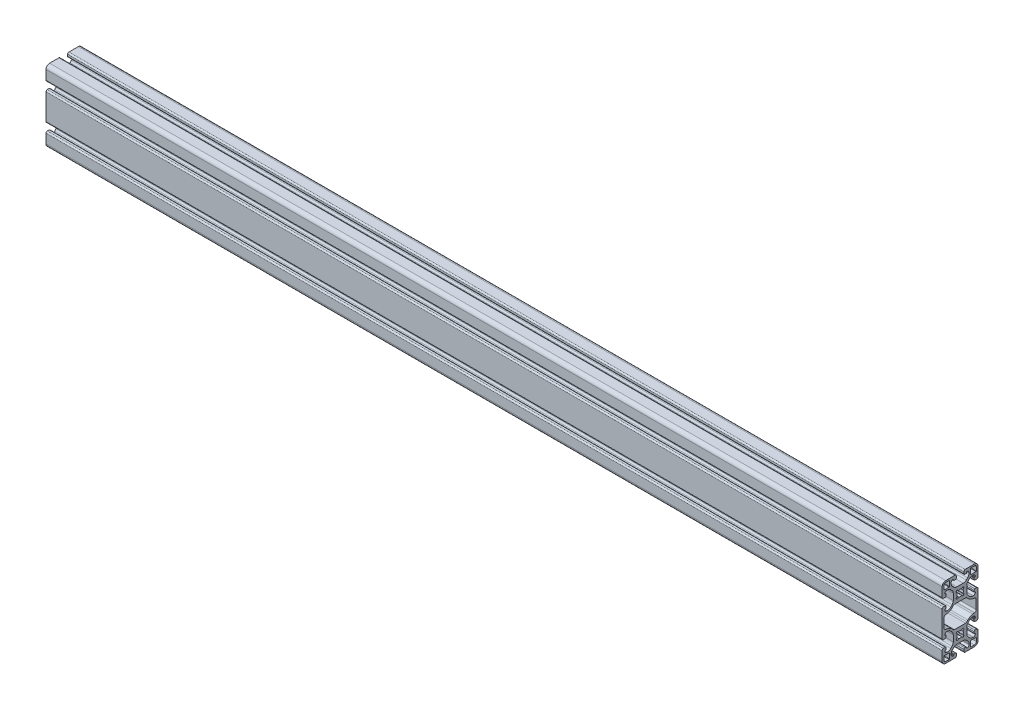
from build123d import *

# Parameters (mm, degrees)
F_40_SARJA_1_0070_40X80_1_DEPTH = 1000


with BuildPart() as part:
    # Model6 → 40-sarja 1.0070 40X80_1 (new body)
    with BuildSketch(Plane(origin=(0, 0, 0), x_dir=(0, -1, 0), z_dir=(1, 0, 0))):
        with BuildLine():
            Line((-13.35, 15.5), (-14.85, 15.5))
            ThreePointArc((-14.85, 15.5), (-15.557106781, 15.792893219), (-15.85, 16.5))
            Line((-15.85, 16.5), (-15.85, 18.5))
            ThreePointArc((-15.85, 18.5), (-15.410660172, 19.560660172), (-14.35, 20))
            Line((-14.35, 20), (14.35, 20))
            ThreePointArc((14.35, 20), (15.410660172, 19.560660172), (15.85, 18.5))
            Line((15.85, 18.5), (15.85, 16.5))
            ThreePointArc((15.85, 16.5), (15.557106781, 15.792893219), (14.85, 15.5))
            Line((14.85, 15.5), (13.35, 15.5))
            ThreePointArc((13.35, 15.5), (12.996446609, 15.646446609), (12.85, 16))
            Line((12.85, 16), (12.85, 16.5))
            ThreePointArc((12.85, 16.5), (12.703553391, 16.853553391), (12.35, 17))
            Line((12.35, 17), (12.15, 17))
            ThreePointArc((12.15, 17), (10.62972042, 16.37027958), (10, 14.85))
            Line((10, 14.85), (10, 14.056360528))
            ThreePointArc((10, 14.056360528), (10.423530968, 12.016585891), (11.624104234, 10.314034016))
            Line((11.624104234, 10.314034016), (13.084905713, 8.947996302))
            ThreePointArc((13.084905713, 8.947996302), (14.664246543, 7.949192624), (16.5, 7.6))
            Line((16.5, 7.6), (23.5, 7.6))
            ThreePointArc((23.5, 7.6), (25.335753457, 7.949192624), (26.915094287, 8.947996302))
            Line((26.915094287, 8.947996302), (28.375895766, 10.314034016))
            ThreePointArc((28.375895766, 10.314034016), (29.576469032, 12.016585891), (30, 14.056360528))
            Line((30, 14.056360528), (30, 14.85))
            ThreePointArc((30, 14.85), (29.37027958, 16.37027958), (27.85, 17))
            Line((27.85, 17), (27.65, 17))
            ThreePointArc((27.65, 17), (27.296446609, 16.853553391), (27.15, 16.5))
            Line((27.15, 16.5), (27.15, 16))
            ThreePointArc((27.15, 16), (27.003553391, 15.646446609), (26.65, 15.5))
            Line((26.65, 15.5), (25.15, 15.5))
            ThreePointArc((25.15, 15.5), (24.442893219, 15.792893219), (24.15, 16.5))
            Line((24.15, 16.5), (24.15, 18.5))
            ThreePointArc((24.15, 18.5), (24.589339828, 19.560660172), (25.65, 20))
            Line((25.65, 20), (36, 20))
            ThreePointArc((36, 20), (38.828427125, 18.828427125), (40, 16))
            Line((40, 16), (40, 5.65))
            ThreePointArc((40, 5.65), (39.560660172, 4.589339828), (38.5, 4.15))
            Line((38.5, 4.15), (36.5, 4.15))
            ThreePointArc((36.5, 4.15), (35.792893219, 4.442893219), (35.5, 5.15))
            Line((35.5, 5.15), (35.5, 6.65))
            ThreePointArc((35.5, 6.65), (35.646446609, 7.003553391), (36, 7.15))
            Line((36, 7.15), (36.5, 7.15))
            ThreePointArc((36.5, 7.15), (36.853553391, 7.296446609), (37, 7.65))
            Line((37, 7.65), (37, 7.85))
            ThreePointArc((37, 7.85), (36.37027958, 9.37027958), (34.85, 10))
            Line((34.85, 10), (34.203267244, 10))
            ThreePointArc((34.203267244, 10), (32.163150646, 9.576049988), (30.460844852, 8.374399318))
            Line((30.460844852, 8.374399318), (29.095763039, 6.912704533))
            ThreePointArc((29.095763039, 6.912704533), (28.098592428, 5.334232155), (27.75, 3.5))
            Line((27.75, 3.5), (27.75, -3.5))
            ThreePointArc((27.75, -3.5), (28.098592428, -5.334232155), (29.095763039, -6.912704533))
            Line((29.095763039, -6.912704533), (30.460844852, -8.374399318))
            ThreePointArc((30.460844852, -8.374399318), (32.163150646, -9.576049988), (34.203267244, -10))
            Line((34.203267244, -10), (34.85, -10))
            ThreePointArc((34.85, -10), (36.37027958, -9.37027958), (37, -7.85))
            Line((37, -7.85), (37, -7.65))
            ThreePointArc((37, -7.65), (36.853553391, -7.296446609), (36.5, -7.15))
            Line((36.5, -7.15), (36, -7.15))
            ThreePointArc((36, -7.15), (35.646446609, -7.003553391), (35.5, -6.65))
            Line((35.5, -6.65), (35.5, -5.15))
            ThreePointArc((35.5, -5.15), (35.792893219, -4.442893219), (36.5, -4.15))
            Line((36.5, -4.15), (38.5, -4.15))
            ThreePointArc((38.5, -4.15), (39.560660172, -4.589339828), (40, -5.65))
            Line((40, -5.65), (40, -16))
            ThreePointArc((40, -16), (38.828427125, -18.828427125), (36, -20))
            Line((36, -20), (25.65, -20))
            ThreePointArc((25.65, -20), (24.589339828, -19.560660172), (24.15, -18.5))
            Line((24.15, -18.5), (24.15, -16.5))
            ThreePointArc((24.15, -16.5), (24.442893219, -15.792893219), (25.15, -15.5))
            Line((25.15, -15.5), (26.65, -15.5))
            ThreePointArc((26.65, -15.5), (27.003553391, -15.646446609), (27.15, -16))
            Line((27.15, -16), (27.15, -16.5))
            ThreePointArc((27.15, -16.5), (27.296446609, -16.853553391), (27.65, -17))
            Line((27.65, -17), (27.85, -17))
            ThreePointArc((27.85, -17), (29.37027958, -16.37027958), (30, -14.85))
            Line((30, -14.85), (30, -14.056360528))
            ThreePointArc((30, -14.056360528), (29.576469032, -12.016585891), (28.375895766, -10.314034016))
            Line((28.375895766, -10.314034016), (26.915094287, -8.947996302))
            ThreePointArc((26.915094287, -8.947996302), (25.335753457, -7.949192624), (23.5, -7.6))
            Line((23.5, -7.6), (16.5, -7.6))
            ThreePointArc((16.5, -7.6), (14.664246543, -7.949192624), (13.084905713, -8.947996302))
            Line((13.084905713, -8.947996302), (11.624104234, -10.314034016))
            ThreePointArc((11.624104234, -10.314034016), (10.423530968, -12.016585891), (10, -14.056360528))
            Line((10, -14.056360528), (10, -14.85))
            ThreePointArc((10, -14.85), (10.62972042, -16.37027958), (12.15, -17))
            Line((12.15, -17), (12.35, -17))
            ThreePointArc((12.35, -17), (12.703553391, -16.853553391), (12.85, -16.5))
            Line((12.85, -16.5), (12.85, -16))
            ThreePointArc((12.85, -16), (12.996446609, -15.646446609), (13.35, -15.5))
            Line((13.35, -15.5), (14.85, -15.5))
            ThreePointArc((14.85, -15.5), (15.557106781, -15.792893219), (15.85, -16.5))
            Line((15.85, -16.5), (15.85, -18.5))
            ThreePointArc((15.85, -18.5), (15.410660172, -19.560660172), (14.35, -20))
            Line((14.35, -20), (-14.35, -20))
            ThreePointArc((-14.35, -20), (-15.410660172, -19.560660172), (-15.85, -18.5))
            Line((-15.85, -18.5), (-15.85, -16.5))
            ThreePointArc((-15.85, -16.5), (-15.557106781, -15.792893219), (-14.85, -15.5))
            Line((-14.85, -15.5), (-13.35, -15.5))
            ThreePointArc((-13.35, -15.5), (-12.996446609, -15.646446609), (-12.85, -16))
            Line((-12.85, -16), (-12.85, -16.5))
            ThreePointArc((-12.85, -16.5), (-12.703553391, -16.853553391), (-12.35, -17))
            Line((-12.35, -17), (-12.15, -17))
            ThreePointArc((-12.15, -17), (-10.62972042, -16.37027958), (-10, -14.85))
            Line((-10, -14.85), (-10, -14.056360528))
            ThreePointArc((-10, -14.056360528), (-10.423530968, -12.016585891), (-11.624104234, -10.314034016))
            Line((-11.624104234, -10.314034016), (-13.084905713, -8.947996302))
            ThreePointArc((-13.084905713, -8.947996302), (-14.664246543, -7.949192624), (-16.5, -7.6))
            Line((-16.5, -7.6), (-23.5, -7.6))
            ThreePointArc((-23.5, -7.6), (-25.335753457, -7.949192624), (-26.915094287, -8.947996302))
            Line((-26.915094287, -8.947996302), (-28.375895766, -10.314034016))
            ThreePointArc((-28.375895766, -10.314034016), (-29.576469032, -12.016585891), (-30, -14.056360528))
            Line((-30, -14.056360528), (-30, -14.85))
            ThreePointArc((-30, -14.85), (-29.37027958, -16.37027958), (-27.85, -17))
            Line((-27.85, -17), (-27.65, -17))
            ThreePointArc((-27.65, -17), (-27.296446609, -16.853553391), (-27.15, -16.5))
            Line((-27.15, -16.5), (-27.15, -16))
            ThreePointArc((-27.15, -16), (-27.003553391, -15.646446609), (-26.65, -15.5))
            Line((-26.65, -15.5), (-25.15, -15.5))
            ThreePointArc((-25.15, -15.5), (-24.442893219, -15.792893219), (-24.15, -16.5))
            Line((-24.15, -16.5), (-24.15, -18.5))
            ThreePointArc((-24.15, -18.5), (-24.589339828, -19.560660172), (-25.65, -20))
            Line((-25.65, -20), (-36, -20))
            ThreePointArc((-36, -20), (-38.828427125, -18.828427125), (-40, -16))
            Line((-40, -16), (-40, -5.65))
            ThreePointArc((-40, -5.65), (-39.560660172, -4.589339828), (-38.5, -4.15))
            Line((-38.5, -4.15), (-36.5, -4.15))
            ThreePointArc((-36.5, -4.15), (-35.792893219, -4.442893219), (-35.5, -5.15))
            Line((-35.5, -5.15), (-35.5, -6.65))
            ThreePointArc((-35.5, -6.65), (-35.646446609, -7.003553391), (-36, -7.15))
            Line((-36, -7.15), (-36.5, -7.15))
            ThreePointArc((-36.5, -7.15), (-36.853553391, -7.296446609), (-37, -7.65))
            Line((-37, -7.65), (-37, -7.85))
            ThreePointArc((-37, -7.85), (-36.37027958, -9.37027958), (-34.85, -10))
            Line((-34.85, -10), (-34.203267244, -10))
            ThreePointArc((-34.203267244, -10), (-32.163150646, -9.576049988), (-30.460844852, -8.374399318))
            Line((-30.460844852, -8.374399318), (-29.095763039, -6.912704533))
            ThreePointArc((-29.095763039, -6.912704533), (-28.098592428, -5.334232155), (-27.75, -3.5))
            Line((-27.75, -3.5), (-27.75, 3.5))
            ThreePointArc((-27.75, 3.5), (-28.098592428, 5.334232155), (-29.095763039, 6.912704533))
            Line((-29.095763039, 6.912704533), (-30.460844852, 8.374399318))
            ThreePointArc((-30.460844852, 8.374399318), (-32.163150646, 9.576049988), (-34.203267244, 10))
            Line((-34.203267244, 10), (-34.85, 10))
            ThreePointArc((-34.85, 10), (-36.37027958, 9.37027958), (-37, 7.85))
            Line((-37, 7.85), (-37, 7.65))
            ThreePointArc((-37, 7.65), (-36.853553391, 7.296446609), (-36.5, 7.15))
            Line((-36.5, 7.15), (-36, 7.15))
            ThreePointArc((-36, 7.15), (-35.646446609, 7.003553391), (-35.5, 6.65))
            Line((-35.5, 6.65), (-35.5, 5.15))
            ThreePointArc((-35.5, 5.15), (-35.792893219, 4.442893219), (-36.5, 4.15))
            Line((-36.5, 4.15), (-38.5, 4.15))
            ThreePointArc((-38.5, 4.15), (-39.560660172, 4.589339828), (-40, 5.65))
            Line((-40, 5.65), (-40, 16))
            ThreePointArc((-40, 16), (-38.828427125, 18.828427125), (-36, 20))
            Line((-36, 20), (-25.65, 20))
            ThreePointArc((-25.65, 20), (-24.589339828, 19.560660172), (-24.15, 18.5))
            Line((-24.15, 18.5), (-24.15, 16.5))
            ThreePointArc((-24.15, 16.5), (-24.442893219, 15.792893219), (-25.15, 15.5))
            Line((-25.15, 15.5), (-26.65, 15.5))
            ThreePointArc((-26.65, 15.5), (-27.003553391, 15.646446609), (-27.15, 16))
            Line((-27.15, 16), (-27.15, 16.5))
            ThreePointArc((-27.15, 16.5), (-27.296446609, 16.853553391), (-27.65, 17))
            Line((-27.65, 17), (-27.85, 17))
            ThreePointArc((-27.85, 17), (-29.37027958, 16.37027958), (-30, 14.85))
            Line((-30, 14.85), (-30, 14.056360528))
            ThreePointArc((-30, 14.056360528), (-29.576469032, 12.016585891), (-28.375895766, 10.314034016))
            Line((-28.375895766, 10.314034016), (-26.915094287, 8.947996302))
            ThreePointArc((-26.915094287, 8.947996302), (-25.335753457, 7.949192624), (-23.5, 7.6))
            Line((-23.5, 7.6), (-16.5, 7.6))
            ThreePointArc((-16.5, 7.6), (-14.664246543, 7.949192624), (-13.084905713, 8.947996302))
            Line((-13.084905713, 8.947996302), (-11.624104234, 10.314034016))
            ThreePointArc((-11.624104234, 10.314034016), (-10.423530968, 12.016585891), (-10, 14.056360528))
            Line((-10, 14.056360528), (-10, 14.85))
            ThreePointArc((-10, 14.85), (-10.62972042, 16.37027958), (-12.15, 17))
            Line((-12.15, 17), (-12.35, 17))
            ThreePointArc((-12.35, 17), (-12.703553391, 16.853553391), (-12.85, 16.5))
            Line((-12.85, 16.5), (-12.85, 16))
            ThreePointArc((-12.85, 16), (-12.996446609, 15.646446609), (-13.35, 15.5))
        make_face()
        with BuildLine():
            Line((-31.8, 17.7), (-31.8, 12.3))
            ThreePointArc((-31.8, 12.3), (-31.946446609, 11.946446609), (-32.3, 11.8))
            Line((-32.3, 11.8), (-37.7, 11.8))
            ThreePointArc((-37.7, 11.8), (-38.053553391, 11.946446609), (-38.2, 12.3))
            Line((-38.2, 12.3), (-38.2, 16))
            ThreePointArc((-38.2, 16), (-37.555634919, 17.555634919), (-36, 18.2))
            Line((-36, 18.2), (-32.3, 18.2))
            ThreePointArc((-32.3, 18.2), (-31.946446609, 18.053553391), (-31.8, 17.7))
        make_face(mode=Mode.SUBTRACT)
        with BuildLine():
            Line((-37.7, -11.8), (-32.3, -11.8))
            ThreePointArc((-32.3, -11.8), (-31.946446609, -11.946446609), (-31.8, -12.3))
            Line((-31.8, -12.3), (-31.8, -17.7))
            ThreePointArc((-31.8, -17.7), (-31.946446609, -18.053553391), (-32.3, -18.2))
            Line((-32.3, -18.2), (-36, -18.2))
            ThreePointArc((-36, -18.2), (-37.555634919, -17.555634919), (-38.2, -16))
            Line((-38.2, -16), (-38.2, -12.3))
            ThreePointArc((-38.2, -12.3), (-38.053553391, -11.946446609), (-37.7, -11.8))
        make_face(mode=Mode.SUBTRACT)
        with BuildLine():
            Line((37.7, 11.8), (32.3, 11.8))
            ThreePointArc((32.3, 11.8), (31.946446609, 11.946446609), (31.8, 12.3))
            Line((31.8, 12.3), (31.8, 17.7))
            ThreePointArc((31.8, 17.7), (31.946446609, 18.053553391), (32.3, 18.2))
            Line((32.3, 18.2), (36, 18.2))
            ThreePointArc((36, 18.2), (37.555634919, 17.555634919), (38.2, 16))
            Line((38.2, 16), (38.2, 12.3))
            ThreePointArc((38.2, 12.3), (38.053553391, 11.946446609), (37.7, 11.8))
        make_face(mode=Mode.SUBTRACT)
        with BuildLine():
            Line((31.8, -17.7), (31.8, -12.3))
            ThreePointArc((31.8, -12.3), (31.946446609, -11.946446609), (32.3, -11.8))
            Line((32.3, -11.8), (37.7, -11.8))
            ThreePointArc((37.7, -11.8), (38.053553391, -11.946446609), (38.2, -12.3))
            Line((38.2, -12.3), (38.2, -16))
            ThreePointArc((38.2, -16), (37.555634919, -17.555634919), (36, -18.2))
            Line((36, -18.2), (32.3, -18.2))
            ThreePointArc((32.3, -18.2), (31.946446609, -18.053553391), (31.8, -17.7))
        make_face(mode=Mode.SUBTRACT)
        with BuildLine():
            Line((15.750046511, 3.542846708), (16.457153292, 4.249953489))
            ThreePointArc((16.457153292, 4.249953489), (16.810706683, 4.396400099), (17.164260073, 4.249953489))
            Line((17.164260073, 4.249953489), (18.224920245, 3.189293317))
            ThreePointArc((18.224920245, 3.189293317), (20, 3.65), (21.775079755, 3.189293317))
            Line((21.775079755, 3.189293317), (22.835739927, 4.249953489))
            ThreePointArc((22.835739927, 4.249953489), (23.189293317, 4.396400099), (23.542846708, 4.249953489))
            Line((23.542846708, 4.249953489), (24.249953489, 3.542846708))
            ThreePointArc((24.249953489, 3.542846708), (24.396400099, 3.189293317), (24.249953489, 2.835739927))
            Line((24.249953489, 2.835739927), (23.189293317, 1.775079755))
            ThreePointArc((23.189293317, 1.775079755), (23.65, 0), (23.189293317, -1.775079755))
            Line((23.189293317, -1.775079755), (24.249953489, -2.835739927))
            ThreePointArc((24.249953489, -2.835739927), (24.396400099, -3.189293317), (24.249953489, -3.542846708))
            Line((24.249953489, -3.542846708), (23.542846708, -4.249953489))
            ThreePointArc((23.542846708, -4.249953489), (23.189293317, -4.396400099), (22.835739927, -4.249953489))
            Line((22.835739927, -4.249953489), (21.775079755, -3.189293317))
            ThreePointArc((21.775079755, -3.189293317), (20, -3.65), (18.224920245, -3.189293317))
            Line((18.224920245, -3.189293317), (17.164260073, -4.249953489))
            ThreePointArc((17.164260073, -4.249953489), (16.810706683, -4.396400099), (16.457153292, -4.249953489))
            Line((16.457153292, -4.249953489), (15.750046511, -3.542846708))
            ThreePointArc((15.750046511, -3.542846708), (15.603599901, -3.189293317), (15.750046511, -2.835739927))
            Line((15.750046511, -2.835739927), (16.810706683, -1.775079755))
            ThreePointArc((16.810706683, -1.775079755), (16.35, 0), (16.810706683, 1.775079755))
            Line((16.810706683, 1.775079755), (15.750046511, 2.835739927))
            ThreePointArc((15.750046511, 2.835739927), (15.603599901, 3.189293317), (15.750046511, 3.542846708))
        make_face(mode=Mode.SUBTRACT)
        with BuildLine():
            Line((-15.750046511, -3.542846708), (-16.457153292, -4.249953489))
            ThreePointArc((-16.457153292, -4.249953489), (-16.810706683, -4.396400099), (-17.164260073, -4.249953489))
            Line((-17.164260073, -4.249953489), (-18.224920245, -3.189293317))
            ThreePointArc((-18.224920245, -3.189293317), (-20, -3.65), (-21.775079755, -3.189293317))
            Line((-21.775079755, -3.189293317), (-22.835739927, -4.249953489))
            ThreePointArc((-22.835739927, -4.249953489), (-23.189293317, -4.396400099), (-23.542846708, -4.249953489))
            Line((-23.542846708, -4.249953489), (-24.249953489, -3.542846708))
            ThreePointArc((-24.249953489, -3.542846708), (-24.396400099, -3.189293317), (-24.249953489, -2.835739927))
            Line((-24.249953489, -2.835739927), (-23.189293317, -1.775079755))
            ThreePointArc((-23.189293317, -1.775079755), (-23.65, 0), (-23.189293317, 1.775079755))
            Line((-23.189293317, 1.775079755), (-24.249953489, 2.835739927))
            ThreePointArc((-24.249953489, 2.835739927), (-24.396400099, 3.189293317), (-24.249953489, 3.542846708))
            Line((-24.249953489, 3.542846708), (-23.542846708, 4.249953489))
            ThreePointArc((-23.542846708, 4.249953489), (-23.189293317, 4.396400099), (-22.835739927, 4.249953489))
            Line((-22.835739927, 4.249953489), (-21.775079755, 3.189293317))
            ThreePointArc((-21.775079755, 3.189293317), (-20, 3.65), (-18.224920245, 3.189293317))
            Line((-18.224920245, 3.189293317), (-17.164260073, 4.249953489))
            ThreePointArc((-17.164260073, 4.249953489), (-16.810706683, 4.396400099), (-16.457153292, 4.249953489))
            Line((-16.457153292, 4.249953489), (-15.750046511, 3.542846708))
            ThreePointArc((-15.750046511, 3.542846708), (-15.603599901, 3.189293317), (-15.750046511, 2.835739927))
            Line((-15.750046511, 2.835739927), (-16.810706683, 1.775079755))
            ThreePointArc((-16.810706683, 1.775079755), (-16.35, 0), (-16.810706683, -1.775079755))
            Line((-16.810706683, -1.775079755), (-15.750046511, -2.835739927))
            ThreePointArc((-15.750046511, -2.835739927), (-15.603599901, -3.189293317), (-15.750046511, -3.542846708))
        make_face(mode=Mode.SUBTRACT)
        with BuildLine():
            Line((10.421468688, 8.700430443), (11.61610231, 7.58329399))
            ThreePointArc((11.61610231, 7.58329399), (12.084693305, 6.918777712), (12.25, 6.122641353))
            Line((12.25, 6.122641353), (12.25, -6.122641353))
            ThreePointArc((12.25, -6.122641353), (12.084693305, -6.918777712), (11.61610231, -7.58329399))
            Line((11.61610231, -7.58329399), (10.421468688, -8.700430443))
            ThreePointArc((10.421468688, -8.700430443), (8.491996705, -11.180710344), (7.42751059, -14.137316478))
            Line((7.42751059, -14.137316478), (7.104026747, -15.839376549))
            ThreePointArc((7.104026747, -15.839376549), (7.064405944, -16.061477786), (7.029805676, -16.284416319))
            ThreePointArc((7.029805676, -16.284416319), (6.359935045, -17.511428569), (5.050132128, -18))
            Line((5.050132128, -18), (-5.050132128, -18))
            ThreePointArc((-5.050132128, -18), (-6.359935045, -17.511428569), (-7.029805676, -16.284416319))
            ThreePointArc((-7.029805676, -16.284416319), (-7.064405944, -16.061477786), (-7.104026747, -15.839376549))
            Line((-7.104026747, -15.839376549), (-7.42751059, -14.137316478))
            ThreePointArc((-7.42751059, -14.137316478), (-8.491996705, -11.180710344), (-10.421468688, -8.700430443))
            Line((-10.421468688, -8.700430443), (-11.61610231, -7.58329399))
            ThreePointArc((-11.61610231, -7.58329399), (-12.084693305, -6.918777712), (-12.25, -6.122641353))
            Line((-12.25, -6.122641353), (-12.25, 6.122641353))
            ThreePointArc((-12.25, 6.122641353), (-12.084693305, 6.918777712), (-11.61610231, 7.58329399))
            Line((-11.61610231, 7.58329399), (-10.421468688, 8.700430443))
            ThreePointArc((-10.421468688, 8.700430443), (-8.491996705, 11.180710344), (-7.42751059, 14.137316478))
            Line((-7.42751059, 14.137316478), (-7.104026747, 15.839376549))
            ThreePointArc((-7.104026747, 15.839376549), (-7.064405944, 16.061477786), (-7.029805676, 16.284416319))
            ThreePointArc((-7.029805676, 16.284416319), (-6.359935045, 17.511428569), (-5.050132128, 18))
            Line((-5.050132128, 18), (5.050132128, 18))
            ThreePointArc((5.050132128, 18), (6.359935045, 17.511428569), (7.029805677, 16.284416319))
            ThreePointArc((7.029805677, 16.284416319), (7.064405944, 16.061477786), (7.104026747, 15.839376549))
            Line((7.104026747, 15.839376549), (7.42751059, 14.137316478))
            ThreePointArc((7.42751059, 14.137316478), (8.491996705, 11.180710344), (10.421468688, 8.700430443))
        make_face(mode=Mode.SUBTRACT)
    extrude(amount=F_40_SARJA_1_0070_40X80_1_DEPTH)


solid = part.part
